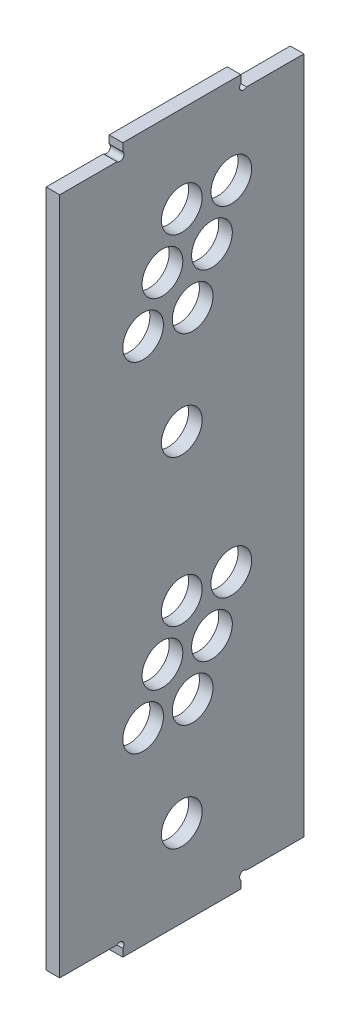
ISO-10303-21;
HEADER;
FILE_DESCRIPTION(('STEP AP214'),'2;1');
FILE_NAME('part.step','',(''),(''),'','','');
FILE_SCHEMA(('AUTOMOTIVE_DESIGN { 1 0 10303 214 1 1 1 1 }'));
ENDSEC;
DATA;
#1=APPLICATION_CONTEXT('core data for automotive mechanical design processes');
#2=APPLICATION_PROTOCOL_DEFINITION('international standard','automotive_design',2000,#1);
#3=PRODUCT_CONTEXT('',#1,'mechanical');
#4=PRODUCT('Part','Part','',(#3));
#5=PRODUCT_RELATED_PRODUCT_CATEGORY('part','',(#4));
#6=PRODUCT_DEFINITION_FORMATION('','',#4);
#7=PRODUCT_DEFINITION_CONTEXT('part definition',#1,'design');
#8=PRODUCT_DEFINITION('design','',#6,#7);
#9=PRODUCT_DEFINITION_SHAPE('','',#8);
#10=(LENGTH_UNIT() NAMED_UNIT(*) SI_UNIT(.MILLI.,.METRE.));
#11=(NAMED_UNIT(*) PLANE_ANGLE_UNIT() SI_UNIT($,.RADIAN.));
#12=(NAMED_UNIT(*) SI_UNIT($,.STERADIAN.) SOLID_ANGLE_UNIT());
#13=UNCERTAINTY_MEASURE_WITH_UNIT(LENGTH_MEASURE(1.E-05),#10,'distance_accuracy_value','');
#14=(GEOMETRIC_REPRESENTATION_CONTEXT(3) GLOBAL_UNCERTAINTY_ASSIGNED_CONTEXT((#13)) GLOBAL_UNIT_ASSIGNED_CONTEXT((#10,
#11,#12)) REPRESENTATION_CONTEXT('',''));
#15=CARTESIAN_POINT('',(0.,0.,0.));
#16=DIRECTION('',(0.,0.,1.));
#17=DIRECTION('',(1.,0.,0.));
#18=AXIS2_PLACEMENT_3D('',#15,#16,#17);
#19=CARTESIAN_POINT('',(-192.695207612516,500.,-4.39119064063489E-13));
#20=DIRECTION('',(0.,-1.,0.));
#21=DIRECTION('',(0.,0.,-1.));
#22=AXIS2_PLACEMENT_3D('',#19,#20,#21);
#23=PLANE('',#22);
#24=DIRECTION('',(-1.,0.,0.));
#25=VECTOR('',#24,1.);
#26=CARTESIAN_POINT('',(-182.695207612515,500.,-137.74264068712));
#27=LINE('',#26,#25);
#28=CARTESIAN_POINT('',(-182.695207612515,500.,-137.74264068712));
#29=VERTEX_POINT('',#28);
#30=CARTESIAN_POINT('',(-192.695207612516,500.,-137.74264068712));
#31=VERTEX_POINT('',#30);
#32=EDGE_CURVE('E144',#29,#31,#27,.T.);
#33=ORIENTED_EDGE('',*,*,#32,.F.);
#34=DIRECTION('',(0.,0.,-1.));
#35=VECTOR('',#34,1.);
#36=CARTESIAN_POINT('',(-182.695207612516,500.,-4.50498850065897E-13));
#37=LINE('',#36,#35);
#38=CARTESIAN_POINT('',(-182.695207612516,500.,-180.));
#39=VERTEX_POINT('',#38);
#40=EDGE_CURVE('E187',#29,#39,#37,.T.);
#41=ORIENTED_EDGE('',*,*,#40,.T.);
#42=DIRECTION('',(1.,0.,0.));
#43=VECTOR('',#42,1.);
#44=CARTESIAN_POINT('',(-192.695207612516,500.,-180.));
#45=LINE('',#44,#43);
#46=CARTESIAN_POINT('',(-192.695207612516,500.,-180.));
#47=VERTEX_POINT('',#46);
#48=EDGE_CURVE('E163',#47,#39,#45,.T.);
#49=ORIENTED_EDGE('',*,*,#48,.F.);
#50=DIRECTION('',(0.,0.,-1.));
#51=VECTOR('',#50,1.);
#52=CARTESIAN_POINT('',(-192.695207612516,500.,-4.39119064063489E-13));
#53=LINE('',#52,#51);
#54=EDGE_CURVE('E156',#31,#47,#53,.T.);
#55=ORIENTED_EDGE('',*,*,#54,.F.);
#56=EDGE_LOOP('',(#33,#41,#49,#55));
#57=FACE_BOUND('',#56,.T.);
#58=ADVANCED_FACE('F33',(#57),#23,.F.);
#59=DIRECTION('',(-1.,0.,0.));
#60=VECTOR('',#59,1.);
#61=CARTESIAN_POINT('',(-182.695207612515,500.,-42.2573593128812));
#62=LINE('',#61,#60);
#63=CARTESIAN_POINT('',(-192.695207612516,500.,-42.2573593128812));
#64=VERTEX_POINT('',#63);
#65=CARTESIAN_POINT('',(-182.695207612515,500.,-42.2573593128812));
#66=VERTEX_POINT('',#65);
#67=EDGE_CURVE('E150',#64,#66,#62,.F.);
#68=ORIENTED_EDGE('',*,*,#67,.F.);
#69=CARTESIAN_POINT('',(-192.695207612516,500.,-4.39119064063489E-13));
#70=VERTEX_POINT('',#69);
#71=EDGE_CURVE('E164',#70,#64,#53,.T.);
#72=ORIENTED_EDGE('',*,*,#71,.F.);
#73=DIRECTION('',(1.,0.,0.));
#74=VECTOR('',#73,1.);
#75=CARTESIAN_POINT('',(-192.695207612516,500.,-4.39119064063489E-13));
#76=LINE('',#75,#74);
#77=CARTESIAN_POINT('',(-182.695207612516,500.,-4.50498850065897E-13));
#78=VERTEX_POINT('',#77);
#79=EDGE_CURVE('E182',#70,#78,#76,.T.);
#80=ORIENTED_EDGE('',*,*,#79,.T.);
#81=EDGE_CURVE('E183',#78,#66,#37,.T.);
#82=ORIENTED_EDGE('',*,*,#81,.T.);
#83=EDGE_LOOP('',(#68,#72,#80,#82));
#84=FACE_BOUND('',#83,.T.);
#85=ADVANCED_FACE('F390',(#84),#23,.F.);
#86=CARTESIAN_POINT('',(-192.695207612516,510.,-46.5000000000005));
#87=DIRECTION('',(0.,0.,1.));
#88=DIRECTION('',(1.,0.,0.));
#89=AXIS2_PLACEMENT_3D('',#86,#87,#88);
#90=PLANE('',#89);
#91=DIRECTION('',(0.,-1.,0.));
#92=VECTOR('',#91,1.);
#93=CARTESIAN_POINT('',(-192.695207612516,510.,-46.5000000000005));
#94=LINE('',#93,#92);
#95=CARTESIAN_POINT('',(-192.695207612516,510.,-46.5000000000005));
#96=VERTEX_POINT('',#95);
#97=CARTESIAN_POINT('',(-192.695207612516,504.242640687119,-46.5000000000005));
#98=VERTEX_POINT('',#97);
#99=EDGE_CURVE('E219',#96,#98,#94,.T.);
#100=ORIENTED_EDGE('',*,*,#99,.T.);
#101=DIRECTION('',(-1.,0.,0.));
#102=VECTOR('',#101,1.);
#103=CARTESIAN_POINT('',(-182.695207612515,504.242640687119,-46.5000000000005));
#104=LINE('',#103,#102);
#105=CARTESIAN_POINT('',(-182.695207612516,504.242640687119,-46.5000000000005));
#106=VERTEX_POINT('',#105);
#107=EDGE_CURVE('E11',#98,#106,#104,.F.);
#108=ORIENTED_EDGE('',*,*,#107,.T.);
#109=DIRECTION('',(0.,-1.,0.));
#110=VECTOR('',#109,1.);
#111=CARTESIAN_POINT('',(-182.695207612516,510.,-46.5000000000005));
#112=LINE('',#111,#110);
#113=CARTESIAN_POINT('',(-182.695207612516,510.,-46.5000000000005));
#114=VERTEX_POINT('',#113);
#115=EDGE_CURVE('E216',#114,#106,#112,.T.);
#116=ORIENTED_EDGE('',*,*,#115,.F.);
#117=DIRECTION('',(-1.,0.,0.));
#118=VECTOR('',#117,1.);
#119=CARTESIAN_POINT('',(-192.695207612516,510.,-46.5000000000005));
#120=LINE('',#119,#118);
#121=EDGE_CURVE('E394',#114,#96,#120,.T.);
#122=ORIENTED_EDGE('',*,*,#121,.T.);
#123=EDGE_LOOP('',(#100,#108,#116,#122));
#124=FACE_BOUND('',#123,.T.);
#125=ADVANCED_FACE('F406',(#124),#90,.T.);
#126=CARTESIAN_POINT('',(-192.695207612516,510.,-133.500000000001));
#127=DIRECTION('',(0.,0.,-1.));
#128=DIRECTION('',(-1.,0.,0.));
#129=AXIS2_PLACEMENT_3D('',#126,#127,#128);
#130=PLANE('',#129);
#131=DIRECTION('',(0.,-1.,0.));
#132=VECTOR('',#131,1.);
#133=CARTESIAN_POINT('',(-182.695207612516,510.,-133.500000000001));
#134=LINE('',#133,#132);
#135=CARTESIAN_POINT('',(-182.695207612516,510.,-133.500000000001));
#136=VERTEX_POINT('',#135);
#137=CARTESIAN_POINT('',(-182.695207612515,504.242640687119,-133.500000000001));
#138=VERTEX_POINT('',#137);
#139=EDGE_CURVE('E210',#136,#138,#134,.T.);
#140=ORIENTED_EDGE('',*,*,#139,.T.);
#141=DIRECTION('',(-1.,0.,0.));
#142=VECTOR('',#141,1.);
#143=CARTESIAN_POINT('',(-182.695207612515,504.242640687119,-133.500000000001));
#144=LINE('',#143,#142);
#145=CARTESIAN_POINT('',(-192.695207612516,504.242640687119,-133.500000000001));
#146=VERTEX_POINT('',#145);
#147=EDGE_CURVE('E40',#138,#146,#144,.T.);
#148=ORIENTED_EDGE('',*,*,#147,.T.);
#149=DIRECTION('',(0.,-1.,0.));
#150=VECTOR('',#149,1.);
#151=CARTESIAN_POINT('',(-192.695207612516,510.,-133.500000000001));
#152=LINE('',#151,#150);
#153=CARTESIAN_POINT('',(-192.695207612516,510.,-133.500000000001));
#154=VERTEX_POINT('',#153);
#155=EDGE_CURVE('E159',#154,#146,#152,.T.);
#156=ORIENTED_EDGE('',*,*,#155,.F.);
#157=DIRECTION('',(1.,0.,0.));
#158=VECTOR('',#157,1.);
#159=CARTESIAN_POINT('',(-192.695207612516,510.,-133.500000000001));
#160=LINE('',#159,#158);
#161=EDGE_CURVE('E212',#154,#136,#160,.T.);
#162=ORIENTED_EDGE('',*,*,#161,.T.);
#163=EDGE_LOOP('',(#140,#148,#156,#162));
#164=FACE_BOUND('',#163,.T.);
#165=ADVANCED_FACE('F208',(#164),#130,.T.);
#166=CARTESIAN_POINT('',(-192.695207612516,0.,-4.39119064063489E-13));
#167=DIRECTION('',(0.,1.,0.));
#168=DIRECTION('',(0.,0.,1.));
#169=AXIS2_PLACEMENT_3D('',#166,#167,#168);
#170=PLANE('',#169);
#171=DIRECTION('',(0.,0.,1.));
#172=VECTOR('',#171,1.);
#173=CARTESIAN_POINT('',(-192.695207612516,0.,-4.39119064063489E-13));
#174=LINE('',#173,#172);
#175=CARTESIAN_POINT('',(-192.695207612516,0.,-42.2573593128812));
#176=VERTEX_POINT('',#175);
#177=CARTESIAN_POINT('',(-192.695207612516,0.,-4.39119064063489E-13));
#178=VERTEX_POINT('',#177);
#179=EDGE_CURVE('E176',#176,#178,#174,.T.);
#180=ORIENTED_EDGE('',*,*,#179,.F.);
#181=DIRECTION('',(-1.,0.,0.));
#182=VECTOR('',#181,1.);
#183=CARTESIAN_POINT('',(-182.695207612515,0.,-42.2573593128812));
#184=LINE('',#183,#182);
#185=CARTESIAN_POINT('',(-182.695207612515,0.,-42.2573593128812));
#186=VERTEX_POINT('',#185);
#187=EDGE_CURVE('E230',#176,#186,#184,.F.);
#188=ORIENTED_EDGE('',*,*,#187,.T.);
#189=DIRECTION('',(0.,0.,1.));
#190=VECTOR('',#189,1.);
#191=CARTESIAN_POINT('',(-182.695207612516,0.,-4.50498850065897E-13));
#192=LINE('',#191,#190);
#193=CARTESIAN_POINT('',(-182.695207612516,0.,-4.50498850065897E-13));
#194=VERTEX_POINT('',#193);
#195=EDGE_CURVE('E189',#186,#194,#192,.T.);
#196=ORIENTED_EDGE('',*,*,#195,.T.);
#197=DIRECTION('',(1.,0.,0.));
#198=VECTOR('',#197,1.);
#199=CARTESIAN_POINT('',(-192.695207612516,0.,-4.39119064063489E-13));
#200=LINE('',#199,#198);
#201=EDGE_CURVE('E194',#178,#194,#200,.T.);
#202=ORIENTED_EDGE('',*,*,#201,.F.);
#203=EDGE_LOOP('',(#180,#188,#196,#202));
#204=FACE_BOUND('',#203,.T.);
#205=ADVANCED_FACE('F379',(#204),#170,.F.);
#206=CARTESIAN_POINT('',(-182.695207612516,0.,-180.));
#207=VERTEX_POINT('',#206);
#208=CARTESIAN_POINT('',(-182.695207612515,0.,-137.74264068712));
#209=VERTEX_POINT('',#208);
#210=EDGE_CURVE('E169',#207,#209,#192,.T.);
#211=ORIENTED_EDGE('',*,*,#210,.T.);
#212=DIRECTION('',(-1.,0.,0.));
#213=VECTOR('',#212,1.);
#214=CARTESIAN_POINT('',(-182.695207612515,0.,-137.74264068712));
#215=LINE('',#214,#213);
#216=CARTESIAN_POINT('',(-192.695207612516,0.,-137.74264068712));
#217=VERTEX_POINT('',#216);
#218=EDGE_CURVE('E238',#209,#217,#215,.T.);
#219=ORIENTED_EDGE('',*,*,#218,.T.);
#220=CARTESIAN_POINT('',(-192.695207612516,0.,-180.));
#221=VERTEX_POINT('',#220);
#222=EDGE_CURVE('E177',#221,#217,#174,.T.);
#223=ORIENTED_EDGE('',*,*,#222,.F.);
#224=DIRECTION('',(1.,0.,0.));
#225=VECTOR('',#224,1.);
#226=CARTESIAN_POINT('',(-192.695207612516,0.,-180.));
#227=LINE('',#226,#225);
#228=EDGE_CURVE('E197',#221,#207,#227,.T.);
#229=ORIENTED_EDGE('',*,*,#228,.T.);
#230=EDGE_LOOP('',(#211,#219,#223,#229));
#231=FACE_BOUND('',#230,.T.);
#232=ADVANCED_FACE('F357',(#231),#170,.F.);
#233=CARTESIAN_POINT('',(-192.695207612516,500.,-180.));
#234=DIRECTION('',(0.,0.,1.));
#235=DIRECTION('',(1.,0.,0.));
#236=AXIS2_PLACEMENT_3D('',#233,#234,#235);
#237=PLANE('',#236);
#238=DIRECTION('',(0.,-1.,0.));
#239=VECTOR('',#238,1.);
#240=CARTESIAN_POINT('',(-182.695207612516,500.,-180.));
#241=LINE('',#240,#239);
#242=EDGE_CURVE('E186',#39,#207,#241,.T.);
#243=ORIENTED_EDGE('',*,*,#242,.T.);
#244=ORIENTED_EDGE('',*,*,#228,.F.);
#245=DIRECTION('',(0.,-1.,0.));
#246=VECTOR('',#245,1.);
#247=CARTESIAN_POINT('',(-192.695207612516,500.,-180.));
#248=LINE('',#247,#246);
#249=EDGE_CURVE('E168',#47,#221,#248,.T.);
#250=ORIENTED_EDGE('',*,*,#249,.F.);
#251=ORIENTED_EDGE('',*,*,#48,.T.);
#252=EDGE_LOOP('',(#243,#244,#250,#251));
#253=FACE_BOUND('',#252,.T.);
#254=ADVANCED_FACE('F352',(#253),#237,.F.);
#255=CARTESIAN_POINT('',(-192.695207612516,500.,-4.39119064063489E-13));
#256=DIRECTION('',(0.,0.,-1.));
#257=DIRECTION('',(-1.,0.,0.));
#258=AXIS2_PLACEMENT_3D('',#255,#256,#257);
#259=PLANE('',#258);
#260=DIRECTION('',(0.,1.,0.));
#261=VECTOR('',#260,1.);
#262=CARTESIAN_POINT('',(-182.695207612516,500.,-4.50498850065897E-13));
#263=LINE('',#262,#261);
#264=EDGE_CURVE('E165',#194,#78,#263,.T.);
#265=ORIENTED_EDGE('',*,*,#264,.T.);
#266=ORIENTED_EDGE('',*,*,#79,.F.);
#267=DIRECTION('',(0.,1.,0.));
#268=VECTOR('',#267,1.);
#269=CARTESIAN_POINT('',(-192.695207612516,500.,-4.39119064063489E-13));
#270=LINE('',#269,#268);
#271=EDGE_CURVE('E180',#178,#70,#270,.T.);
#272=ORIENTED_EDGE('',*,*,#271,.F.);
#273=ORIENTED_EDGE('',*,*,#201,.T.);
#274=EDGE_LOOP('',(#265,#266,#272,#273));
#275=FACE_BOUND('',#274,.T.);
#276=ADVANCED_FACE('F385',(#275),#259,.F.);
#277=CARTESIAN_POINT('',(-192.695207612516,0.,2.08577977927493E-13));
#278=DIRECTION('',(-1.,0.,0.));
#279=DIRECTION('',(0.,0.,1.));
#280=AXIS2_PLACEMENT_3D('',#277,#278,#279);
#281=PLANE('',#280);
#282=ORIENTED_EDGE('',*,*,#155,.T.);
#283=CARTESIAN_POINT('',(-192.695207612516,502.12132034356,-135.62132034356));
#284=DIRECTION('',(1.,0.,0.));
#285=DIRECTION('',(0.,0.,1.));
#286=AXIS2_PLACEMENT_3D('',#283,#284,#285);
#287=CIRCLE('',#286,2.99999999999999);
#288=EDGE_CURVE('E54',#146,#31,#287,.T.);
#289=ORIENTED_EDGE('',*,*,#288,.T.);
#290=ORIENTED_EDGE('',*,*,#54,.T.);
#291=ORIENTED_EDGE('',*,*,#249,.T.);
#292=ORIENTED_EDGE('',*,*,#222,.T.);
#293=CARTESIAN_POINT('',(-192.695207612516,-2.12132034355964,-135.62132034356));
#294=DIRECTION('',(-1.,0.,0.));
#295=DIRECTION('',(0.,0.,1.));
#296=AXIS2_PLACEMENT_3D('',#293,#294,#295);
#297=CIRCLE('',#296,2.99999999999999);
#298=CARTESIAN_POINT('',(-192.695207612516,-4.24264068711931,-133.5));
#299=VERTEX_POINT('',#298);
#300=EDGE_CURVE('E231',#299,#217,#297,.T.);
#301=ORIENTED_EDGE('',*,*,#300,.F.);
#302=DIRECTION('',(0.,1.,0.));
#303=VECTOR('',#302,1.);
#304=CARTESIAN_POINT('',(-192.695207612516,-10.,-133.5));
#305=LINE('',#304,#303);
#306=CARTESIAN_POINT('',(-192.695207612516,-10.,-133.5));
#307=VERTEX_POINT('',#306);
#308=EDGE_CURVE('E259',#307,#299,#305,.T.);
#309=ORIENTED_EDGE('',*,*,#308,.F.);
#310=DIRECTION('',(0.,0.,-1.));
#311=VECTOR('',#310,1.);
#312=CARTESIAN_POINT('',(-192.695207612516,-10.,-46.5000000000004));
#313=LINE('',#312,#311);
#314=CARTESIAN_POINT('',(-192.695207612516,-10.,-46.5000000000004));
#315=VERTEX_POINT('',#314);
#316=EDGE_CURVE('E241',#315,#307,#313,.T.);
#317=ORIENTED_EDGE('',*,*,#316,.F.);
#318=DIRECTION('',(0.,1.,0.));
#319=VECTOR('',#318,1.);
#320=CARTESIAN_POINT('',(-192.695207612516,-10.,-46.5000000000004));
#321=LINE('',#320,#319);
#322=CARTESIAN_POINT('',(-192.695207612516,-4.24264068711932,-46.5000000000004));
#323=VERTEX_POINT('',#322);
#324=EDGE_CURVE('E250',#315,#323,#321,.T.);
#325=ORIENTED_EDGE('',*,*,#324,.T.);
#326=CARTESIAN_POINT('',(-192.695207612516,-2.12132034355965,-44.3786796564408));
#327=DIRECTION('',(-1.,0.,0.));
#328=DIRECTION('',(0.,0.,-1.));
#329=AXIS2_PLACEMENT_3D('',#326,#327,#328);
#330=CIRCLE('',#329,2.99999999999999);
#331=EDGE_CURVE('E226',#176,#323,#330,.T.);
#332=ORIENTED_EDGE('',*,*,#331,.F.);
#333=ORIENTED_EDGE('',*,*,#179,.T.);
#334=ORIENTED_EDGE('',*,*,#271,.T.);
#335=ORIENTED_EDGE('',*,*,#71,.T.);
#336=CARTESIAN_POINT('',(-192.695207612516,502.12132034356,-44.3786796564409));
#337=DIRECTION('',(1.,0.,0.));
#338=DIRECTION('',(0.,0.,-1.));
#339=AXIS2_PLACEMENT_3D('',#336,#337,#338);
#340=CIRCLE('',#339,2.99999999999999);
#341=EDGE_CURVE('E387',#64,#98,#340,.T.);
#342=ORIENTED_EDGE('',*,*,#341,.T.);
#343=ORIENTED_EDGE('',*,*,#99,.F.);
#344=DIRECTION('',(0.,0.,-1.));
#345=VECTOR('',#344,1.);
#346=CARTESIAN_POINT('',(-192.695207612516,510.,-46.5000000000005));
#347=LINE('',#346,#345);
#348=EDGE_CURVE('E392',#96,#154,#347,.T.);
#349=ORIENTED_EDGE('',*,*,#348,.T.);
#350=EDGE_LOOP('',(#282,#289,#290,#291,#292,#301,#309,#317,#325,#332,#333,#334,#335,#342,#343,#349));
#351=FACE_BOUND('',#350,.T.);
#352=CARTESIAN_POINT('',(-192.695207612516,304.,-90.0000000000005));
#353=DIRECTION('',(-1.,0.,0.));
#354=DIRECTION('',(0.,0.,1.));
#355=AXIS2_PLACEMENT_3D('',#352,#353,#354);
#356=CIRCLE('',#355,15.);
#357=CARTESIAN_POINT('',(-192.695207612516,304.,-75.0000000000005));
#358=VERTEX_POINT('',#357);
#359=EDGE_CURVE('E301',#358,#358,#356,.T.);
#360=ORIENTED_EDGE('',*,*,#359,.F.);
#361=EDGE_LOOP('',(#360));
#362=FACE_BOUND('',#361,.T.);
#363=CARTESIAN_POINT('',(-192.695207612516,379.,-61.5000000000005));
#364=DIRECTION('',(-1.,0.,0.));
#365=DIRECTION('',(0.,0.,1.));
#366=AXIS2_PLACEMENT_3D('',#363,#364,#365);
#367=CIRCLE('',#366,15.);
#368=CARTESIAN_POINT('',(-192.695207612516,379.,-46.5000000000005));
#369=VERTEX_POINT('',#368);
#370=EDGE_CURVE('E298',#369,#369,#367,.T.);
#371=ORIENTED_EDGE('',*,*,#370,.F.);
#372=EDGE_LOOP('',(#371));
#373=FACE_BOUND('',#372,.T.);
#374=CARTESIAN_POINT('',(-192.695207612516,446.,-90.0000000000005));
#375=DIRECTION('',(-1.,0.,0.));
#376=DIRECTION('',(0.,0.,1.));
#377=AXIS2_PLACEMENT_3D('',#374,#375,#376);
#378=CIRCLE('',#377,15.);
#379=CARTESIAN_POINT('',(-192.695207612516,446.,-75.0000000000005));
#380=VERTEX_POINT('',#379);
#381=EDGE_CURVE('E295',#380,#380,#378,.T.);
#382=ORIENTED_EDGE('',*,*,#381,.F.);
#383=EDGE_LOOP('',(#382));
#384=FACE_BOUND('',#383,.T.);
#385=CARTESIAN_POINT('',(-192.695207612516,379.,-98.0000000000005));
#386=DIRECTION('',(-1.,0.,0.));
#387=DIRECTION('',(0.,0.,1.));
#388=AXIS2_PLACEMENT_3D('',#385,#386,#387);
#389=CIRCLE('',#388,15.);
#390=CARTESIAN_POINT('',(-192.695207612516,379.,-83.0000000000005));
#391=VERTEX_POINT('',#390);
#392=EDGE_CURVE('E292',#391,#391,#389,.T.);
#393=ORIENTED_EDGE('',*,*,#392,.F.);
#394=EDGE_LOOP('',(#393));
#395=FACE_BOUND('',#394,.T.);
#396=CARTESIAN_POINT('',(-192.695207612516,412.5,-112.25));
#397=DIRECTION('',(-1.,0.,0.));
#398=DIRECTION('',(0.,0.,1.));
#399=AXIS2_PLACEMENT_3D('',#396,#397,#398);
#400=CIRCLE('',#399,15.);
#401=CARTESIAN_POINT('',(-192.695207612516,412.5,-97.2500000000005));
#402=VERTEX_POINT('',#401);
#403=EDGE_CURVE('E289',#402,#402,#400,.T.);
#404=ORIENTED_EDGE('',*,*,#403,.F.);
#405=EDGE_LOOP('',(#404));
#406=FACE_BOUND('',#405,.T.);
#407=CARTESIAN_POINT('',(-192.695207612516,446.,-126.5));
#408=DIRECTION('',(-1.,0.,0.));
#409=DIRECTION('',(0.,0.,1.));
#410=AXIS2_PLACEMENT_3D('',#407,#408,#409);
#411=CIRCLE('',#410,15.);
#412=CARTESIAN_POINT('',(-192.695207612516,446.,-111.5));
#413=VERTEX_POINT('',#412);
#414=EDGE_CURVE('E286',#413,#413,#411,.T.);
#415=ORIENTED_EDGE('',*,*,#414,.F.);
#416=EDGE_LOOP('',(#415));
#417=FACE_BOUND('',#416,.T.);
#418=CARTESIAN_POINT('',(-192.695207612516,412.5,-75.7500000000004));
#419=DIRECTION('',(-1.,0.,0.));
#420=DIRECTION('',(0.,0.,1.));
#421=AXIS2_PLACEMENT_3D('',#418,#419,#420);
#422=CIRCLE('',#421,15.);
#423=CARTESIAN_POINT('',(-192.695207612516,412.5,-60.7500000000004));
#424=VERTEX_POINT('',#423);
#425=EDGE_CURVE('E266',#424,#424,#422,.T.);
#426=ORIENTED_EDGE('',*,*,#425,.F.);
#427=EDGE_LOOP('',(#426));
#428=FACE_BOUND('',#427,.T.);
#429=CARTESIAN_POINT('',(-192.695207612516,54.,-90.0000000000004));
#430=DIRECTION('',(-1.,0.,0.));
#431=DIRECTION('',(0.,0.,1.));
#432=AXIS2_PLACEMENT_3D('',#429,#430,#431);
#433=CIRCLE('',#432,15.);
#434=CARTESIAN_POINT('',(-192.695207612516,54.,-75.0000000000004));
#435=VERTEX_POINT('',#434);
#436=EDGE_CURVE('E173',#435,#435,#433,.T.);
#437=ORIENTED_EDGE('',*,*,#436,.F.);
#438=EDGE_LOOP('',(#437));
#439=FACE_BOUND('',#438,.T.);
#440=CARTESIAN_POINT('',(-192.695207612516,129.,-61.5000000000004));
#441=DIRECTION('',(-1.,0.,0.));
#442=DIRECTION('',(0.,0.,1.));
#443=AXIS2_PLACEMENT_3D('',#440,#441,#442);
#444=CIRCLE('',#443,15.);
#445=CARTESIAN_POINT('',(-192.695207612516,129.,-46.5000000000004));
#446=VERTEX_POINT('',#445);
#447=EDGE_CURVE('E339',#446,#446,#444,.T.);
#448=ORIENTED_EDGE('',*,*,#447,.F.);
#449=EDGE_LOOP('',(#448));
#450=FACE_BOUND('',#449,.T.);
#451=CARTESIAN_POINT('',(-192.695207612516,196.,-90.0000000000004));
#452=DIRECTION('',(-1.,0.,0.));
#453=DIRECTION('',(0.,0.,1.));
#454=AXIS2_PLACEMENT_3D('',#451,#452,#453);
#455=CIRCLE('',#454,15.);
#456=CARTESIAN_POINT('',(-192.695207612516,196.,-75.0000000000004));
#457=VERTEX_POINT('',#456);
#458=EDGE_CURVE('E337',#457,#457,#455,.T.);
#459=ORIENTED_EDGE('',*,*,#458,.F.);
#460=EDGE_LOOP('',(#459));
#461=FACE_BOUND('',#460,.T.);
#462=CARTESIAN_POINT('',(-192.695207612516,129.,-98.0000000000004));
#463=DIRECTION('',(-1.,0.,0.));
#464=DIRECTION('',(0.,0.,1.));
#465=AXIS2_PLACEMENT_3D('',#462,#463,#464);
#466=CIRCLE('',#465,15.);
#467=CARTESIAN_POINT('',(-192.695207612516,129.,-83.0000000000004));
#468=VERTEX_POINT('',#467);
#469=EDGE_CURVE('E334',#468,#468,#466,.T.);
#470=ORIENTED_EDGE('',*,*,#469,.F.);
#471=EDGE_LOOP('',(#470));
#472=FACE_BOUND('',#471,.T.);
#473=CARTESIAN_POINT('',(-192.695207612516,162.5,-112.25));
#474=DIRECTION('',(-1.,0.,0.));
#475=DIRECTION('',(0.,0.,1.));
#476=AXIS2_PLACEMENT_3D('',#473,#474,#475);
#477=CIRCLE('',#476,15.);
#478=CARTESIAN_POINT('',(-192.695207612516,162.5,-97.2500000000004));
#479=VERTEX_POINT('',#478);
#480=EDGE_CURVE('E331',#479,#479,#477,.T.);
#481=ORIENTED_EDGE('',*,*,#480,.F.);
#482=EDGE_LOOP('',(#481));
#483=FACE_BOUND('',#482,.T.);
#484=CARTESIAN_POINT('',(-192.695207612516,196.,-126.5));
#485=DIRECTION('',(-1.,0.,0.));
#486=DIRECTION('',(0.,0.,1.));
#487=AXIS2_PLACEMENT_3D('',#484,#485,#486);
#488=CIRCLE('',#487,15.);
#489=CARTESIAN_POINT('',(-192.695207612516,196.,-111.5));
#490=VERTEX_POINT('',#489);
#491=EDGE_CURVE('E328',#490,#490,#488,.T.);
#492=ORIENTED_EDGE('',*,*,#491,.F.);
#493=EDGE_LOOP('',(#492));
#494=FACE_BOUND('',#493,.T.);
#495=CARTESIAN_POINT('',(-192.695207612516,162.5,-75.7500000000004));
#496=DIRECTION('',(-1.,0.,0.));
#497=DIRECTION('',(0.,0.,1.));
#498=AXIS2_PLACEMENT_3D('',#495,#496,#497);
#499=CIRCLE('',#498,15.);
#500=CARTESIAN_POINT('',(-192.695207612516,162.5,-60.7500000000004));
#501=VERTEX_POINT('',#500);
#502=EDGE_CURVE('E308',#501,#501,#499,.T.);
#503=ORIENTED_EDGE('',*,*,#502,.F.);
#504=EDGE_LOOP('',(#503));
#505=FACE_BOUND('',#504,.T.);
#506=ADVANCED_FACE('F154',(#351,#362,#373,#384,#395,#406,#417,#428,#439,#450,#461,#472,#483,
#494,#505),#281,.T.);
#507=CARTESIAN_POINT('',(-182.695207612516,0.,1.97198191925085E-13));
#508=DIRECTION('',(-1.,0.,0.));
#509=DIRECTION('',(0.,0.,1.));
#510=AXIS2_PLACEMENT_3D('',#507,#508,#509);
#511=PLANE('',#510);
#512=CARTESIAN_POINT('',(-182.695207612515,502.12132034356,-135.62132034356));
#513=DIRECTION('',(1.,0.,0.));
#514=DIRECTION('',(0.,0.,1.));
#515=AXIS2_PLACEMENT_3D('',#512,#513,#514);
#516=CIRCLE('',#515,2.99999999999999);
#517=EDGE_CURVE('E146',#138,#29,#516,.T.);
#518=ORIENTED_EDGE('',*,*,#517,.F.);
#519=ORIENTED_EDGE('',*,*,#139,.F.);
#520=DIRECTION('',(0.,0.,1.));
#521=VECTOR('',#520,1.);
#522=CARTESIAN_POINT('',(-182.695207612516,510.,-46.5000000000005));
#523=LINE('',#522,#521);
#524=EDGE_CURVE('E400',#136,#114,#523,.T.);
#525=ORIENTED_EDGE('',*,*,#524,.T.);
#526=ORIENTED_EDGE('',*,*,#115,.T.);
#527=CARTESIAN_POINT('',(-182.695207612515,502.12132034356,-44.3786796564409));
#528=DIRECTION('',(1.,0.,0.));
#529=DIRECTION('',(0.,0.,-1.));
#530=AXIS2_PLACEMENT_3D('',#527,#528,#529);
#531=CIRCLE('',#530,2.99999999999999);
#532=EDGE_CURVE('E47',#66,#106,#531,.T.);
#533=ORIENTED_EDGE('',*,*,#532,.F.);
#534=ORIENTED_EDGE('',*,*,#81,.F.);
#535=ORIENTED_EDGE('',*,*,#264,.F.);
#536=ORIENTED_EDGE('',*,*,#195,.F.);
#537=CARTESIAN_POINT('',(-182.695207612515,-2.12132034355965,-44.3786796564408));
#538=DIRECTION('',(-1.,0.,0.));
#539=DIRECTION('',(0.,0.,-1.));
#540=AXIS2_PLACEMENT_3D('',#537,#538,#539);
#541=CIRCLE('',#540,2.99999999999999);
#542=CARTESIAN_POINT('',(-182.695207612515,-4.2426406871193,-46.5000000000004));
#543=VERTEX_POINT('',#542);
#544=EDGE_CURVE('E233',#186,#543,#541,.T.);
#545=ORIENTED_EDGE('',*,*,#544,.T.);
#546=DIRECTION('',(0.,1.,0.));
#547=VECTOR('',#546,1.);
#548=CARTESIAN_POINT('',(-182.695207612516,-10.,-46.5000000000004));
#549=LINE('',#548,#547);
#550=CARTESIAN_POINT('',(-182.695207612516,-10.,-46.5000000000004));
#551=VERTEX_POINT('',#550);
#552=EDGE_CURVE('E253',#551,#543,#549,.T.);
#553=ORIENTED_EDGE('',*,*,#552,.F.);
#554=DIRECTION('',(0.,0.,1.));
#555=VECTOR('',#554,1.);
#556=CARTESIAN_POINT('',(-182.695207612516,-10.,-46.5000000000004));
#557=LINE('',#556,#555);
#558=CARTESIAN_POINT('',(-182.695207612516,-10.,-133.5));
#559=VERTEX_POINT('',#558);
#560=EDGE_CURVE('E246',#559,#551,#557,.T.);
#561=ORIENTED_EDGE('',*,*,#560,.F.);
#562=DIRECTION('',(0.,1.,0.));
#563=VECTOR('',#562,1.);
#564=CARTESIAN_POINT('',(-182.695207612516,-10.,-133.5));
#565=LINE('',#564,#563);
#566=CARTESIAN_POINT('',(-182.695207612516,-4.24264068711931,-133.5));
#567=VERTEX_POINT('',#566);
#568=EDGE_CURVE('E256',#559,#567,#565,.T.);
#569=ORIENTED_EDGE('',*,*,#568,.T.);
#570=CARTESIAN_POINT('',(-182.695207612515,-2.12132034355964,-135.62132034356));
#571=DIRECTION('',(-1.,0.,0.));
#572=DIRECTION('',(0.,0.,1.));
#573=AXIS2_PLACEMENT_3D('',#570,#571,#572);
#574=CIRCLE('',#573,2.99999999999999);
#575=EDGE_CURVE('E227',#567,#209,#574,.T.);
#576=ORIENTED_EDGE('',*,*,#575,.T.);
#577=ORIENTED_EDGE('',*,*,#210,.F.);
#578=ORIENTED_EDGE('',*,*,#242,.F.);
#579=ORIENTED_EDGE('',*,*,#40,.F.);
#580=EDGE_LOOP('',(#518,#519,#525,#526,#533,#534,#535,#536,#545,#553,#561,#569,#576,#577,#578,#579));
#581=FACE_BOUND('',#580,.T.);
#582=CARTESIAN_POINT('',(-182.695207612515,304.,-90.0000000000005));
#583=DIRECTION('',(-1.,0.,0.));
#584=DIRECTION('',(0.,0.,1.));
#585=AXIS2_PLACEMENT_3D('',#582,#583,#584);
#586=CIRCLE('',#585,15.);
#587=CARTESIAN_POINT('',(-182.695207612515,304.,-75.0000000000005));
#588=VERTEX_POINT('',#587);
#589=EDGE_CURVE('E263',#588,#588,#586,.T.);
#590=ORIENTED_EDGE('',*,*,#589,.T.);
#591=EDGE_LOOP('',(#590));
#592=FACE_BOUND('',#591,.T.);
#593=CARTESIAN_POINT('',(-182.695207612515,379.,-61.5000000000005));
#594=DIRECTION('',(-1.,0.,0.));
#595=DIRECTION('',(0.,0.,1.));
#596=AXIS2_PLACEMENT_3D('',#593,#594,#595);
#597=CIRCLE('',#596,15.);
#598=CARTESIAN_POINT('',(-182.695207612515,379.,-46.5000000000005));
#599=VERTEX_POINT('',#598);
#600=EDGE_CURVE('E262',#599,#599,#597,.T.);
#601=ORIENTED_EDGE('',*,*,#600,.T.);
#602=EDGE_LOOP('',(#601));
#603=FACE_BOUND('',#602,.T.);
#604=CARTESIAN_POINT('',(-182.695207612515,446.,-90.0000000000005));
#605=DIRECTION('',(-1.,0.,0.));
#606=DIRECTION('',(0.,0.,1.));
#607=AXIS2_PLACEMENT_3D('',#604,#605,#606);
#608=CIRCLE('',#607,15.);
#609=CARTESIAN_POINT('',(-182.695207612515,446.,-75.0000000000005));
#610=VERTEX_POINT('',#609);
#611=EDGE_CURVE('E268',#610,#610,#608,.T.);
#612=ORIENTED_EDGE('',*,*,#611,.T.);
#613=EDGE_LOOP('',(#612));
#614=FACE_BOUND('',#613,.T.);
#615=CARTESIAN_POINT('',(-182.695207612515,379.,-98.0000000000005));
#616=DIRECTION('',(-1.,0.,0.));
#617=DIRECTION('',(0.,0.,1.));
#618=AXIS2_PLACEMENT_3D('',#615,#616,#617);
#619=CIRCLE('',#618,15.);
#620=CARTESIAN_POINT('',(-182.695207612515,379.,-83.0000000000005));
#621=VERTEX_POINT('',#620);
#622=EDGE_CURVE('E267',#621,#621,#619,.T.);
#623=ORIENTED_EDGE('',*,*,#622,.T.);
#624=EDGE_LOOP('',(#623));
#625=FACE_BOUND('',#624,.T.);
#626=CARTESIAN_POINT('',(-182.695207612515,412.5,-112.25));
#627=DIRECTION('',(-1.,0.,0.));
#628=DIRECTION('',(0.,0.,1.));
#629=AXIS2_PLACEMENT_3D('',#626,#627,#628);
#630=CIRCLE('',#629,15.);
#631=CARTESIAN_POINT('',(-182.695207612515,412.5,-97.2500000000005));
#632=VERTEX_POINT('',#631);
#633=EDGE_CURVE('E277',#632,#632,#630,.T.);
#634=ORIENTED_EDGE('',*,*,#633,.T.);
#635=EDGE_LOOP('',(#634));
#636=FACE_BOUND('',#635,.T.);
#637=CARTESIAN_POINT('',(-182.695207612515,446.,-126.5));
#638=DIRECTION('',(-1.,0.,0.));
#639=DIRECTION('',(0.,0.,1.));
#640=AXIS2_PLACEMENT_3D('',#637,#638,#639);
#641=CIRCLE('',#640,15.);
#642=CARTESIAN_POINT('',(-182.695207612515,446.,-111.5));
#643=VERTEX_POINT('',#642);
#644=EDGE_CURVE('E274',#643,#643,#641,.T.);
#645=ORIENTED_EDGE('',*,*,#644,.T.);
#646=EDGE_LOOP('',(#645));
#647=FACE_BOUND('',#646,.T.);
#648=CARTESIAN_POINT('',(-182.695207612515,412.5,-75.7500000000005));
#649=DIRECTION('',(-1.,0.,0.));
#650=DIRECTION('',(0.,0.,1.));
#651=AXIS2_PLACEMENT_3D('',#648,#649,#650);
#652=CIRCLE('',#651,15.);
#653=CARTESIAN_POINT('',(-182.695207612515,412.5,-60.7500000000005));
#654=VERTEX_POINT('',#653);
#655=EDGE_CURVE('E271',#654,#654,#652,.T.);
#656=ORIENTED_EDGE('',*,*,#655,.T.);
#657=EDGE_LOOP('',(#656));
#658=FACE_BOUND('',#657,.T.);
#659=CARTESIAN_POINT('',(-182.695207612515,54.,-90.0000000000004));
#660=DIRECTION('',(-1.,0.,0.));
#661=DIRECTION('',(0.,0.,1.));
#662=AXIS2_PLACEMENT_3D('',#659,#660,#661);
#663=CIRCLE('',#662,15.);
#664=CARTESIAN_POINT('',(-182.695207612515,54.,-75.0000000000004));
#665=VERTEX_POINT('',#664);
#666=EDGE_CURVE('E305',#665,#665,#663,.T.);
#667=ORIENTED_EDGE('',*,*,#666,.T.);
#668=EDGE_LOOP('',(#667));
#669=FACE_BOUND('',#668,.T.);
#670=CARTESIAN_POINT('',(-182.695207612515,129.,-61.5000000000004));
#671=DIRECTION('',(-1.,0.,0.));
#672=DIRECTION('',(0.,0.,1.));
#673=AXIS2_PLACEMENT_3D('',#670,#671,#672);
#674=CIRCLE('',#673,15.);
#675=CARTESIAN_POINT('',(-182.695207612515,129.,-46.5000000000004));
#676=VERTEX_POINT('',#675);
#677=EDGE_CURVE('E304',#676,#676,#674,.T.);
#678=ORIENTED_EDGE('',*,*,#677,.T.);
#679=EDGE_LOOP('',(#678));
#680=FACE_BOUND('',#679,.T.);
#681=CARTESIAN_POINT('',(-182.695207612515,196.,-90.0000000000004));
#682=DIRECTION('',(-1.,0.,0.));
#683=DIRECTION('',(0.,0.,1.));
#684=AXIS2_PLACEMENT_3D('',#681,#682,#683);
#685=CIRCLE('',#684,15.);
#686=CARTESIAN_POINT('',(-182.695207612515,196.,-75.0000000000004));
#687=VERTEX_POINT('',#686);
#688=EDGE_CURVE('E310',#687,#687,#685,.T.);
#689=ORIENTED_EDGE('',*,*,#688,.T.);
#690=EDGE_LOOP('',(#689));
#691=FACE_BOUND('',#690,.T.);
#692=CARTESIAN_POINT('',(-182.695207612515,129.,-98.0000000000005));
#693=DIRECTION('',(-1.,0.,0.));
#694=DIRECTION('',(0.,0.,1.));
#695=AXIS2_PLACEMENT_3D('',#692,#693,#694);
#696=CIRCLE('',#695,15.);
#697=CARTESIAN_POINT('',(-182.695207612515,129.,-83.0000000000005));
#698=VERTEX_POINT('',#697);
#699=EDGE_CURVE('E309',#698,#698,#696,.T.);
#700=ORIENTED_EDGE('',*,*,#699,.T.);
#701=EDGE_LOOP('',(#700));
#702=FACE_BOUND('',#701,.T.);
#703=CARTESIAN_POINT('',(-182.695207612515,162.5,-112.25));
#704=DIRECTION('',(-1.,0.,0.));
#705=DIRECTION('',(0.,0.,1.));
#706=AXIS2_PLACEMENT_3D('',#703,#704,#705);
#707=CIRCLE('',#706,15.);
#708=CARTESIAN_POINT('',(-182.695207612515,162.5,-97.2500000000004));
#709=VERTEX_POINT('',#708);
#710=EDGE_CURVE('E319',#709,#709,#707,.T.);
#711=ORIENTED_EDGE('',*,*,#710,.T.);
#712=EDGE_LOOP('',(#711));
#713=FACE_BOUND('',#712,.T.);
#714=CARTESIAN_POINT('',(-182.695207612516,196.,-126.5));
#715=DIRECTION('',(-1.,0.,0.));
#716=DIRECTION('',(0.,0.,1.));
#717=AXIS2_PLACEMENT_3D('',#714,#715,#716);
#718=CIRCLE('',#717,15.);
#719=CARTESIAN_POINT('',(-182.695207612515,196.,-111.5));
#720=VERTEX_POINT('',#719);
#721=EDGE_CURVE('E316',#720,#720,#718,.T.);
#722=ORIENTED_EDGE('',*,*,#721,.T.);
#723=EDGE_LOOP('',(#722));
#724=FACE_BOUND('',#723,.T.);
#725=CARTESIAN_POINT('',(-182.695207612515,162.5,-75.7500000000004));
#726=DIRECTION('',(-1.,0.,0.));
#727=DIRECTION('',(0.,0.,1.));
#728=AXIS2_PLACEMENT_3D('',#725,#726,#727);
#729=CIRCLE('',#728,15.);
#730=CARTESIAN_POINT('',(-182.695207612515,162.5,-60.7500000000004));
#731=VERTEX_POINT('',#730);
#732=EDGE_CURVE('E313',#731,#731,#729,.T.);
#733=ORIENTED_EDGE('',*,*,#732,.T.);
#734=EDGE_LOOP('',(#733));
#735=FACE_BOUND('',#734,.T.);
#736=ADVANCED_FACE('F348',(#581,#592,#603,#614,#625,#636,#647,#658,#669,#680,#691,#702,#713,
#724,#735),#511,.F.);
#737=CARTESIAN_POINT('',(-182.695207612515,162.5,-75.7500000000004));
#738=DIRECTION('',(-1.,0.,0.));
#739=DIRECTION('',(0.,0.,1.));
#740=AXIS2_PLACEMENT_3D('',#737,#738,#739);
#741=CYLINDRICAL_SURFACE('',#740,15.);
#742=ORIENTED_EDGE('',*,*,#502,.T.);
#743=EDGE_LOOP('',(#742));
#744=FACE_BOUND('',#743,.T.);
#745=ORIENTED_EDGE('',*,*,#732,.F.);
#746=EDGE_LOOP('',(#745));
#747=FACE_BOUND('',#746,.T.);
#748=ADVANCED_FACE('F483',(#744,#747),#741,.F.);
#749=CARTESIAN_POINT('',(-182.695207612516,196.,-126.5));
#750=DIRECTION('',(-1.,0.,0.));
#751=DIRECTION('',(0.,0.,1.));
#752=AXIS2_PLACEMENT_3D('',#749,#750,#751);
#753=CYLINDRICAL_SURFACE('',#752,15.);
#754=ORIENTED_EDGE('',*,*,#491,.T.);
#755=EDGE_LOOP('',(#754));
#756=FACE_BOUND('',#755,.T.);
#757=ORIENTED_EDGE('',*,*,#721,.F.);
#758=EDGE_LOOP('',(#757));
#759=FACE_BOUND('',#758,.T.);
#760=ADVANCED_FACE('F479',(#756,#759),#753,.F.);
#761=CARTESIAN_POINT('',(-182.695207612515,162.5,-112.25));
#762=DIRECTION('',(-1.,0.,0.));
#763=DIRECTION('',(0.,0.,1.));
#764=AXIS2_PLACEMENT_3D('',#761,#762,#763);
#765=CYLINDRICAL_SURFACE('',#764,15.);
#766=ORIENTED_EDGE('',*,*,#480,.T.);
#767=EDGE_LOOP('',(#766));
#768=FACE_BOUND('',#767,.T.);
#769=ORIENTED_EDGE('',*,*,#710,.F.);
#770=EDGE_LOOP('',(#769));
#771=FACE_BOUND('',#770,.T.);
#772=ADVANCED_FACE('F482',(#768,#771),#765,.F.);
#773=CARTESIAN_POINT('',(-182.695207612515,129.,-98.0000000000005));
#774=DIRECTION('',(-1.,0.,0.));
#775=DIRECTION('',(0.,0.,1.));
#776=AXIS2_PLACEMENT_3D('',#773,#774,#775);
#777=CYLINDRICAL_SURFACE('',#776,15.);
#778=ORIENTED_EDGE('',*,*,#469,.T.);
#779=EDGE_LOOP('',(#778));
#780=FACE_BOUND('',#779,.T.);
#781=ORIENTED_EDGE('',*,*,#699,.F.);
#782=EDGE_LOOP('',(#781));
#783=FACE_BOUND('',#782,.T.);
#784=ADVANCED_FACE('F475',(#780,#783),#777,.F.);
#785=CARTESIAN_POINT('',(-182.695207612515,196.,-90.0000000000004));
#786=DIRECTION('',(-1.,0.,0.));
#787=DIRECTION('',(0.,0.,1.));
#788=AXIS2_PLACEMENT_3D('',#785,#786,#787);
#789=CYLINDRICAL_SURFACE('',#788,15.);
#790=ORIENTED_EDGE('',*,*,#458,.T.);
#791=EDGE_LOOP('',(#790));
#792=FACE_BOUND('',#791,.T.);
#793=ORIENTED_EDGE('',*,*,#688,.F.);
#794=EDGE_LOOP('',(#793));
#795=FACE_BOUND('',#794,.T.);
#796=ADVANCED_FACE('F472',(#792,#795),#789,.F.);
#797=CARTESIAN_POINT('',(-182.695207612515,129.,-61.5000000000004));
#798=DIRECTION('',(-1.,0.,0.));
#799=DIRECTION('',(0.,0.,1.));
#800=AXIS2_PLACEMENT_3D('',#797,#798,#799);
#801=CYLINDRICAL_SURFACE('',#800,15.);
#802=ORIENTED_EDGE('',*,*,#447,.T.);
#803=EDGE_LOOP('',(#802));
#804=FACE_BOUND('',#803,.T.);
#805=ORIENTED_EDGE('',*,*,#677,.F.);
#806=EDGE_LOOP('',(#805));
#807=FACE_BOUND('',#806,.T.);
#808=ADVANCED_FACE('F471',(#804,#807),#801,.F.);
#809=CARTESIAN_POINT('',(-182.695207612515,54.,-90.0000000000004));
#810=DIRECTION('',(-1.,0.,0.));
#811=DIRECTION('',(0.,0.,1.));
#812=AXIS2_PLACEMENT_3D('',#809,#810,#811);
#813=CYLINDRICAL_SURFACE('',#812,15.);
#814=ORIENTED_EDGE('',*,*,#436,.T.);
#815=EDGE_LOOP('',(#814));
#816=FACE_BOUND('',#815,.T.);
#817=ORIENTED_EDGE('',*,*,#666,.F.);
#818=EDGE_LOOP('',(#817));
#819=FACE_BOUND('',#818,.T.);
#820=ADVANCED_FACE('F461',(#816,#819),#813,.F.);
#821=CARTESIAN_POINT('',(-182.695207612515,412.5,-75.7500000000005));
#822=DIRECTION('',(-1.,0.,0.));
#823=DIRECTION('',(0.,0.,1.));
#824=AXIS2_PLACEMENT_3D('',#821,#822,#823);
#825=CYLINDRICAL_SURFACE('',#824,15.);
#826=ORIENTED_EDGE('',*,*,#425,.T.);
#827=EDGE_LOOP('',(#826));
#828=FACE_BOUND('',#827,.T.);
#829=ORIENTED_EDGE('',*,*,#655,.F.);
#830=EDGE_LOOP('',(#829));
#831=FACE_BOUND('',#830,.T.);
#832=ADVANCED_FACE('F457',(#828,#831),#825,.F.);
#833=CARTESIAN_POINT('',(-182.695207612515,446.,-126.5));
#834=DIRECTION('',(-1.,0.,0.));
#835=DIRECTION('',(0.,0.,1.));
#836=AXIS2_PLACEMENT_3D('',#833,#834,#835);
#837=CYLINDRICAL_SURFACE('',#836,15.);
#838=ORIENTED_EDGE('',*,*,#414,.T.);
#839=EDGE_LOOP('',(#838));
#840=FACE_BOUND('',#839,.T.);
#841=ORIENTED_EDGE('',*,*,#644,.F.);
#842=EDGE_LOOP('',(#841));
#843=FACE_BOUND('',#842,.T.);
#844=ADVANCED_FACE('F453',(#840,#843),#837,.F.);
#845=CARTESIAN_POINT('',(-182.695207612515,412.5,-112.25));
#846=DIRECTION('',(-1.,0.,0.));
#847=DIRECTION('',(0.,0.,1.));
#848=AXIS2_PLACEMENT_3D('',#845,#846,#847);
#849=CYLINDRICAL_SURFACE('',#848,15.);
#850=ORIENTED_EDGE('',*,*,#403,.T.);
#851=EDGE_LOOP('',(#850));
#852=FACE_BOUND('',#851,.T.);
#853=ORIENTED_EDGE('',*,*,#633,.F.);
#854=EDGE_LOOP('',(#853));
#855=FACE_BOUND('',#854,.T.);
#856=ADVANCED_FACE('F456',(#852,#855),#849,.F.);
#857=CARTESIAN_POINT('',(-182.695207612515,379.,-98.0000000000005));
#858=DIRECTION('',(-1.,0.,0.));
#859=DIRECTION('',(0.,0.,1.));
#860=AXIS2_PLACEMENT_3D('',#857,#858,#859);
#861=CYLINDRICAL_SURFACE('',#860,15.);
#862=ORIENTED_EDGE('',*,*,#392,.T.);
#863=EDGE_LOOP('',(#862));
#864=FACE_BOUND('',#863,.T.);
#865=ORIENTED_EDGE('',*,*,#622,.F.);
#866=EDGE_LOOP('',(#865));
#867=FACE_BOUND('',#866,.T.);
#868=ADVANCED_FACE('F448',(#864,#867),#861,.F.);
#869=CARTESIAN_POINT('',(-182.695207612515,446.,-90.0000000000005));
#870=DIRECTION('',(-1.,0.,0.));
#871=DIRECTION('',(0.,0.,1.));
#872=AXIS2_PLACEMENT_3D('',#869,#870,#871);
#873=CYLINDRICAL_SURFACE('',#872,15.);
#874=ORIENTED_EDGE('',*,*,#381,.T.);
#875=EDGE_LOOP('',(#874));
#876=FACE_BOUND('',#875,.T.);
#877=ORIENTED_EDGE('',*,*,#611,.F.);
#878=EDGE_LOOP('',(#877));
#879=FACE_BOUND('',#878,.T.);
#880=ADVANCED_FACE('F445',(#876,#879),#873,.F.);
#881=CARTESIAN_POINT('',(-182.695207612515,379.,-61.5000000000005));
#882=DIRECTION('',(-1.,0.,0.));
#883=DIRECTION('',(0.,0.,1.));
#884=AXIS2_PLACEMENT_3D('',#881,#882,#883);
#885=CYLINDRICAL_SURFACE('',#884,15.);
#886=ORIENTED_EDGE('',*,*,#370,.T.);
#887=EDGE_LOOP('',(#886));
#888=FACE_BOUND('',#887,.T.);
#889=ORIENTED_EDGE('',*,*,#600,.F.);
#890=EDGE_LOOP('',(#889));
#891=FACE_BOUND('',#890,.T.);
#892=ADVANCED_FACE('F443',(#888,#891),#885,.F.);
#893=CARTESIAN_POINT('',(-182.695207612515,304.,-90.0000000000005));
#894=DIRECTION('',(-1.,0.,0.));
#895=DIRECTION('',(0.,0.,1.));
#896=AXIS2_PLACEMENT_3D('',#893,#894,#895);
#897=CYLINDRICAL_SURFACE('',#896,15.);
#898=ORIENTED_EDGE('',*,*,#359,.T.);
#899=EDGE_LOOP('',(#898));
#900=FACE_BOUND('',#899,.T.);
#901=ORIENTED_EDGE('',*,*,#589,.F.);
#902=EDGE_LOOP('',(#901));
#903=FACE_BOUND('',#902,.T.);
#904=ADVANCED_FACE('F440',(#900,#903),#897,.F.);
#905=CARTESIAN_POINT('',(-192.695207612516,-10.,-133.5));
#906=DIRECTION('',(0.,0.,1.));
#907=DIRECTION('',(0.,-1.,0.));
#908=AXIS2_PLACEMENT_3D('',#905,#906,#907);
#909=PLANE('',#908);
#910=ORIENTED_EDGE('',*,*,#308,.T.);
#911=DIRECTION('',(-1.,0.,0.));
#912=VECTOR('',#911,1.);
#913=CARTESIAN_POINT('',(-182.695207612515,-4.24264068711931,-133.5));
#914=LINE('',#913,#912);
#915=EDGE_CURVE('E204',#299,#567,#914,.F.);
#916=ORIENTED_EDGE('',*,*,#915,.T.);
#917=ORIENTED_EDGE('',*,*,#568,.F.);
#918=DIRECTION('',(1.,0.,0.));
#919=VECTOR('',#918,1.);
#920=CARTESIAN_POINT('',(-192.695207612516,-10.,-133.5));
#921=LINE('',#920,#919);
#922=EDGE_CURVE('E244',#307,#559,#921,.T.);
#923=ORIENTED_EDGE('',*,*,#922,.F.);
#924=EDGE_LOOP('',(#910,#916,#917,#923));
#925=FACE_BOUND('',#924,.T.);
#926=ADVANCED_FACE('F364',(#925),#909,.F.);
#927=CARTESIAN_POINT('',(-192.695207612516,-10.,-46.5000000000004));
#928=DIRECTION('',(0.,0.,-1.));
#929=DIRECTION('',(-1.,0.,0.));
#930=AXIS2_PLACEMENT_3D('',#927,#928,#929);
#931=PLANE('',#930);
#932=ORIENTED_EDGE('',*,*,#552,.T.);
#933=DIRECTION('',(-1.,0.,0.));
#934=VECTOR('',#933,1.);
#935=CARTESIAN_POINT('',(-182.695207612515,-4.2426406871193,-46.5000000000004));
#936=LINE('',#935,#934);
#937=EDGE_CURVE('E201',#543,#323,#936,.T.);
#938=ORIENTED_EDGE('',*,*,#937,.T.);
#939=ORIENTED_EDGE('',*,*,#324,.F.);
#940=DIRECTION('',(-1.,0.,0.));
#941=VECTOR('',#940,1.);
#942=CARTESIAN_POINT('',(-192.695207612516,-10.,-46.5000000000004));
#943=LINE('',#942,#941);
#944=EDGE_CURVE('E248',#551,#315,#943,.T.);
#945=ORIENTED_EDGE('',*,*,#944,.F.);
#946=EDGE_LOOP('',(#932,#938,#939,#945));
#947=FACE_BOUND('',#946,.T.);
#948=ADVANCED_FACE('F372',(#947),#931,.F.);
#949=CARTESIAN_POINT('',(0.,-10.,0.));
#950=DIRECTION('',(0.,-1.,0.));
#951=DIRECTION('',(0.,0.,-1.));
#952=AXIS2_PLACEMENT_3D('',#949,#950,#951);
#953=PLANE('',#952);
#954=ORIENTED_EDGE('',*,*,#316,.T.);
#955=ORIENTED_EDGE('',*,*,#922,.T.);
#956=ORIENTED_EDGE('',*,*,#560,.T.);
#957=ORIENTED_EDGE('',*,*,#944,.T.);
#958=EDGE_LOOP('',(#954,#955,#956,#957));
#959=FACE_BOUND('',#958,.T.);
#960=ADVANCED_FACE('F369',(#959),#953,.T.);
#961=CARTESIAN_POINT('',(-182.695207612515,-2.12132034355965,-44.3786796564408));
#962=DIRECTION('',(-1.,0.,0.));
#963=DIRECTION('',(0.,0.,1.));
#964=AXIS2_PLACEMENT_3D('',#961,#962,#963);
#965=CYLINDRICAL_SURFACE('',#964,2.99999999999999);
#966=ORIENTED_EDGE('',*,*,#331,.T.);
#967=ORIENTED_EDGE('',*,*,#937,.F.);
#968=ORIENTED_EDGE('',*,*,#544,.F.);
#969=ORIENTED_EDGE('',*,*,#187,.F.);
#970=EDGE_LOOP('',(#966,#967,#968,#969));
#971=FACE_BOUND('',#970,.T.);
#972=ADVANCED_FACE('F375',(#971),#965,.F.);
#973=CARTESIAN_POINT('',(-182.695207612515,-2.12132034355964,-135.62132034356));
#974=DIRECTION('',(-1.,0.,0.));
#975=DIRECTION('',(0.,0.,1.));
#976=AXIS2_PLACEMENT_3D('',#973,#974,#975);
#977=CYLINDRICAL_SURFACE('',#976,2.99999999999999);
#978=ORIENTED_EDGE('',*,*,#575,.F.);
#979=ORIENTED_EDGE('',*,*,#915,.F.);
#980=ORIENTED_EDGE('',*,*,#300,.T.);
#981=ORIENTED_EDGE('',*,*,#218,.F.);
#982=EDGE_LOOP('',(#978,#979,#980,#981));
#983=FACE_BOUND('',#982,.T.);
#984=ADVANCED_FACE('F359',(#983),#977,.F.);
#985=CARTESIAN_POINT('',(0.,510.,0.));
#986=DIRECTION('',(0.,1.,0.));
#987=DIRECTION('',(0.,0.,-1.));
#988=AXIS2_PLACEMENT_3D('',#985,#986,#987);
#989=PLANE('',#988);
#990=ORIENTED_EDGE('',*,*,#348,.F.);
#991=ORIENTED_EDGE('',*,*,#121,.F.);
#992=ORIENTED_EDGE('',*,*,#524,.F.);
#993=ORIENTED_EDGE('',*,*,#161,.F.);
#994=EDGE_LOOP('',(#990,#991,#992,#993));
#995=FACE_BOUND('',#994,.T.);
#996=ADVANCED_FACE('F404',(#995),#989,.T.);
#997=CARTESIAN_POINT('',(-182.695207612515,502.12132034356,-135.62132034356));
#998=DIRECTION('',(-1.,0.,0.));
#999=DIRECTION('',(0.,0.,1.));
#1000=AXIS2_PLACEMENT_3D('',#997,#998,#999);
#1001=CYLINDRICAL_SURFACE('',#1000,2.99999999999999);
#1002=ORIENTED_EDGE('',*,*,#32,.T.);
#1003=ORIENTED_EDGE('',*,*,#288,.F.);
#1004=ORIENTED_EDGE('',*,*,#147,.F.);
#1005=ORIENTED_EDGE('',*,*,#517,.T.);
#1006=EDGE_LOOP('',(#1002,#1003,#1004,#1005));
#1007=FACE_BOUND('',#1006,.T.);
#1008=ADVANCED_FACE('F145',(#1007),#1001,.F.);
#1009=CARTESIAN_POINT('',(-182.695207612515,502.12132034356,-44.3786796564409));
#1010=DIRECTION('',(-1.,0.,0.));
#1011=DIRECTION('',(0.,0.,1.));
#1012=AXIS2_PLACEMENT_3D('',#1009,#1010,#1011);
#1013=CYLINDRICAL_SURFACE('',#1012,2.99999999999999);
#1014=ORIENTED_EDGE('',*,*,#67,.T.);
#1015=ORIENTED_EDGE('',*,*,#532,.T.);
#1016=ORIENTED_EDGE('',*,*,#107,.F.);
#1017=ORIENTED_EDGE('',*,*,#341,.F.);
#1018=EDGE_LOOP('',(#1014,#1015,#1016,#1017));
#1019=FACE_BOUND('',#1018,.T.);
#1020=ADVANCED_FACE('F407',(#1019),#1013,.F.);
#1021=CLOSED_SHELL('',(#58,#85,#125,#165,#205,#232,#254,#276,#506,#736,#748,#760,#772,#784,#796,
#808,#820,#832,#844,#856,#868,#880,#892,#904,#926,#948,#960,#972,#984,#996,#1008,#1020));
#1022=MANIFOLD_SOLID_BREP('B2',#1021);
#1023=ADVANCED_BREP_SHAPE_REPRESENTATION('',(#18,#1022),#14);
#1024=SHAPE_DEFINITION_REPRESENTATION(#9,#1023);
ENDSEC;
END-ISO-10303-21;
